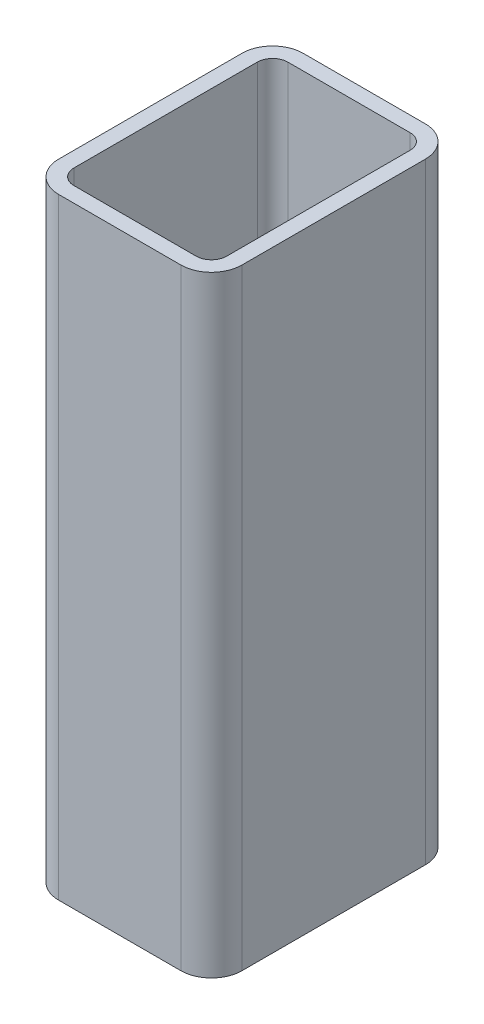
ISO-10303-21;
HEADER;
FILE_DESCRIPTION(('STEP AP214'),'2;1');
FILE_NAME('part.step','',(''),(''),'','','');
FILE_SCHEMA(('AUTOMOTIVE_DESIGN { 1 0 10303 214 1 1 1 1 }'));
ENDSEC;
DATA;
#1=APPLICATION_CONTEXT('core data for automotive mechanical design processes');
#2=APPLICATION_PROTOCOL_DEFINITION('international standard','automotive_design',2000,#1);
#3=PRODUCT_CONTEXT('',#1,'mechanical');
#4=PRODUCT('Part','Part','',(#3));
#5=PRODUCT_RELATED_PRODUCT_CATEGORY('part','',(#4));
#6=PRODUCT_DEFINITION_FORMATION('','',#4);
#7=PRODUCT_DEFINITION_CONTEXT('part definition',#1,'design');
#8=PRODUCT_DEFINITION('design','',#6,#7);
#9=PRODUCT_DEFINITION_SHAPE('','',#8);
#10=(LENGTH_UNIT() NAMED_UNIT(*) SI_UNIT(.MILLI.,.METRE.));
#11=(NAMED_UNIT(*) PLANE_ANGLE_UNIT() SI_UNIT($,.RADIAN.));
#12=(NAMED_UNIT(*) SI_UNIT($,.STERADIAN.) SOLID_ANGLE_UNIT());
#13=UNCERTAINTY_MEASURE_WITH_UNIT(LENGTH_MEASURE(1.E-05),#10,'distance_accuracy_value','');
#14=(GEOMETRIC_REPRESENTATION_CONTEXT(3) GLOBAL_UNCERTAINTY_ASSIGNED_CONTEXT((#13)) GLOBAL_UNIT_ASSIGNED_CONTEXT((#10,
#11,#12)) REPRESENTATION_CONTEXT('',''));
#15=CARTESIAN_POINT('',(0.,0.,0.));
#16=DIRECTION('',(0.,0.,1.));
#17=DIRECTION('',(1.,0.,0.));
#18=AXIS2_PLACEMENT_3D('',#15,#16,#17);
#19=CARTESIAN_POINT('',(-25.4,254.,38.1));
#20=DIRECTION('',(0.,-1.,0.));
#21=DIRECTION('',(0.,0.,-1.));
#22=AXIS2_PLACEMENT_3D('',#19,#20,#21);
#23=CYLINDRICAL_SURFACE('',#22,12.7);
#24=CARTESIAN_POINT('',(-25.4,0.,38.1));
#25=DIRECTION('',(0.,1.,0.));
#26=DIRECTION('',(0.,0.,1.));
#27=AXIS2_PLACEMENT_3D('',#24,#25,#26);
#28=CIRCLE('',#27,12.7);
#29=CARTESIAN_POINT('',(-38.1,0.,38.1));
#30=VERTEX_POINT('',#29);
#31=CARTESIAN_POINT('',(-25.4,0.,50.8));
#32=VERTEX_POINT('',#31);
#33=EDGE_CURVE('E185',#30,#32,#28,.T.);
#34=ORIENTED_EDGE('',*,*,#33,.T.);
#35=DIRECTION('',(0.,-1.,0.));
#36=VECTOR('',#35,1.);
#37=CARTESIAN_POINT('',(-25.4,254.,50.8));
#38=LINE('',#37,#36);
#39=CARTESIAN_POINT('',(-25.4,254.,50.8));
#40=VERTEX_POINT('',#39);
#41=EDGE_CURVE('E11',#40,#32,#38,.T.);
#42=ORIENTED_EDGE('',*,*,#41,.F.);
#43=CARTESIAN_POINT('',(-25.4,254.,38.1));
#44=DIRECTION('',(0.,1.,0.));
#45=DIRECTION('',(0.,0.,1.));
#46=AXIS2_PLACEMENT_3D('',#43,#44,#45);
#47=CIRCLE('',#46,12.7);
#48=CARTESIAN_POINT('',(-38.1,254.,38.1));
#49=VERTEX_POINT('',#48);
#50=EDGE_CURVE('E223',#49,#40,#47,.T.);
#51=ORIENTED_EDGE('',*,*,#50,.F.);
#52=DIRECTION('',(0.,-1.,0.));
#53=VECTOR('',#52,1.);
#54=CARTESIAN_POINT('',(-38.1,254.,38.1));
#55=LINE('',#54,#53);
#56=EDGE_CURVE('E155',#49,#30,#55,.T.);
#57=ORIENTED_EDGE('',*,*,#56,.T.);
#58=EDGE_LOOP('',(#34,#42,#51,#57));
#59=FACE_BOUND('',#58,.T.);
#60=ADVANCED_FACE('F30',(#59),#23,.T.);
#61=CARTESIAN_POINT('',(-25.4,254.,50.8));
#62=DIRECTION('',(0.,0.,-1.));
#63=DIRECTION('',(-1.,0.,0.));
#64=AXIS2_PLACEMENT_3D('',#61,#62,#63);
#65=PLANE('',#64);
#66=DIRECTION('',(1.,0.,0.));
#67=VECTOR('',#66,1.);
#68=CARTESIAN_POINT('',(-25.4,0.,50.8));
#69=LINE('',#68,#67);
#70=CARTESIAN_POINT('',(25.4,0.,50.8));
#71=VERTEX_POINT('',#70);
#72=EDGE_CURVE('E188',#32,#71,#69,.T.);
#73=ORIENTED_EDGE('',*,*,#72,.T.);
#74=DIRECTION('',(0.,-1.,0.));
#75=VECTOR('',#74,1.);
#76=CARTESIAN_POINT('',(25.4,254.,50.8));
#77=LINE('',#76,#75);
#78=CARTESIAN_POINT('',(25.4,254.,50.8));
#79=VERTEX_POINT('',#78);
#80=EDGE_CURVE('E39',#79,#71,#77,.T.);
#81=ORIENTED_EDGE('',*,*,#80,.F.);
#82=DIRECTION('',(1.,0.,0.));
#83=VECTOR('',#82,1.);
#84=CARTESIAN_POINT('',(-25.4,254.,50.8));
#85=LINE('',#84,#83);
#86=EDGE_CURVE('E225',#40,#79,#85,.T.);
#87=ORIENTED_EDGE('',*,*,#86,.F.);
#88=ORIENTED_EDGE('',*,*,#41,.T.);
#89=EDGE_LOOP('',(#73,#81,#87,#88));
#90=FACE_BOUND('',#89,.T.);
#91=ADVANCED_FACE('F299',(#90),#65,.F.);
#92=CARTESIAN_POINT('',(25.4,254.,38.1));
#93=DIRECTION('',(0.,-1.,0.));
#94=DIRECTION('',(0.,0.,-1.));
#95=AXIS2_PLACEMENT_3D('',#92,#93,#94);
#96=CYLINDRICAL_SURFACE('',#95,12.7);
#97=CARTESIAN_POINT('',(25.4,0.,38.1));
#98=DIRECTION('',(0.,1.,0.));
#99=DIRECTION('',(0.,0.,1.));
#100=AXIS2_PLACEMENT_3D('',#97,#98,#99);
#101=CIRCLE('',#100,12.7);
#102=CARTESIAN_POINT('',(38.1,0.,38.1));
#103=VERTEX_POINT('',#102);
#104=EDGE_CURVE('E190',#71,#103,#101,.T.);
#105=ORIENTED_EDGE('',*,*,#104,.T.);
#106=DIRECTION('',(0.,-1.,0.));
#107=VECTOR('',#106,1.);
#108=CARTESIAN_POINT('',(38.1,254.,38.1));
#109=LINE('',#108,#107);
#110=CARTESIAN_POINT('',(38.1,254.,38.1));
#111=VERTEX_POINT('',#110);
#112=EDGE_CURVE('E251',#111,#103,#109,.T.);
#113=ORIENTED_EDGE('',*,*,#112,.F.);
#114=CARTESIAN_POINT('',(25.4,254.,38.1));
#115=DIRECTION('',(0.,1.,0.));
#116=DIRECTION('',(0.,0.,1.));
#117=AXIS2_PLACEMENT_3D('',#114,#115,#116);
#118=CIRCLE('',#117,12.7);
#119=EDGE_CURVE('E227',#79,#111,#118,.T.);
#120=ORIENTED_EDGE('',*,*,#119,.F.);
#121=ORIENTED_EDGE('',*,*,#80,.T.);
#122=EDGE_LOOP('',(#105,#113,#120,#121));
#123=FACE_BOUND('',#122,.T.);
#124=ADVANCED_FACE('F305',(#123),#96,.T.);
#125=CARTESIAN_POINT('',(38.1,254.,-38.1));
#126=DIRECTION('',(-1.,0.,0.));
#127=DIRECTION('',(0.,0.,1.));
#128=AXIS2_PLACEMENT_3D('',#125,#126,#127);
#129=PLANE('',#128);
#130=DIRECTION('',(0.,0.,-1.));
#131=VECTOR('',#130,1.);
#132=CARTESIAN_POINT('',(38.1,0.,-38.1));
#133=LINE('',#132,#131);
#134=CARTESIAN_POINT('',(38.1,0.,-38.1));
#135=VERTEX_POINT('',#134);
#136=EDGE_CURVE('E192',#103,#135,#133,.T.);
#137=ORIENTED_EDGE('',*,*,#136,.T.);
#138=DIRECTION('',(0.,-1.,0.));
#139=VECTOR('',#138,1.);
#140=CARTESIAN_POINT('',(38.1,254.,-38.1));
#141=LINE('',#140,#139);
#142=CARTESIAN_POINT('',(38.1,254.,-38.1));
#143=VERTEX_POINT('',#142);
#144=EDGE_CURVE('E248',#143,#135,#141,.T.);
#145=ORIENTED_EDGE('',*,*,#144,.F.);
#146=DIRECTION('',(0.,0.,-1.));
#147=VECTOR('',#146,1.);
#148=CARTESIAN_POINT('',(38.1,254.,-38.1));
#149=LINE('',#148,#147);
#150=EDGE_CURVE('E229',#111,#143,#149,.T.);
#151=ORIENTED_EDGE('',*,*,#150,.F.);
#152=ORIENTED_EDGE('',*,*,#112,.T.);
#153=EDGE_LOOP('',(#137,#145,#151,#152));
#154=FACE_BOUND('',#153,.T.);
#155=ADVANCED_FACE('F401',(#154),#129,.F.);
#156=CARTESIAN_POINT('',(25.4,254.,-38.1));
#157=DIRECTION('',(0.,-1.,0.));
#158=DIRECTION('',(0.,0.,-1.));
#159=AXIS2_PLACEMENT_3D('',#156,#157,#158);
#160=CYLINDRICAL_SURFACE('',#159,12.7);
#161=CARTESIAN_POINT('',(25.4,0.,-38.1));
#162=DIRECTION('',(0.,1.,0.));
#163=DIRECTION('',(0.,0.,1.));
#164=AXIS2_PLACEMENT_3D('',#161,#162,#163);
#165=CIRCLE('',#164,12.7);
#166=CARTESIAN_POINT('',(25.4,0.,-50.8));
#167=VERTEX_POINT('',#166);
#168=EDGE_CURVE('E194',#135,#167,#165,.T.);
#169=ORIENTED_EDGE('',*,*,#168,.T.);
#170=DIRECTION('',(0.,-1.,0.));
#171=VECTOR('',#170,1.);
#172=CARTESIAN_POINT('',(25.4,254.,-50.8));
#173=LINE('',#172,#171);
#174=CARTESIAN_POINT('',(25.4,254.,-50.8));
#175=VERTEX_POINT('',#174);
#176=EDGE_CURVE('E245',#175,#167,#173,.T.);
#177=ORIENTED_EDGE('',*,*,#176,.F.);
#178=CARTESIAN_POINT('',(25.4,254.,-38.1));
#179=DIRECTION('',(0.,1.,0.));
#180=DIRECTION('',(0.,0.,1.));
#181=AXIS2_PLACEMENT_3D('',#178,#179,#180);
#182=CIRCLE('',#181,12.7);
#183=EDGE_CURVE('E231',#143,#175,#182,.T.);
#184=ORIENTED_EDGE('',*,*,#183,.F.);
#185=ORIENTED_EDGE('',*,*,#144,.T.);
#186=EDGE_LOOP('',(#169,#177,#184,#185));
#187=FACE_BOUND('',#186,.T.);
#188=ADVANCED_FACE('F409',(#187),#160,.T.);
#189=CARTESIAN_POINT('',(25.4,254.,-50.8));
#190=DIRECTION('',(0.,0.,1.));
#191=DIRECTION('',(1.,0.,0.));
#192=AXIS2_PLACEMENT_3D('',#189,#190,#191);
#193=PLANE('',#192);
#194=DIRECTION('',(-1.,0.,0.));
#195=VECTOR('',#194,1.);
#196=CARTESIAN_POINT('',(25.4,0.,-50.8));
#197=LINE('',#196,#195);
#198=CARTESIAN_POINT('',(-25.4,0.,-50.8));
#199=VERTEX_POINT('',#198);
#200=EDGE_CURVE('E196',#167,#199,#197,.T.);
#201=ORIENTED_EDGE('',*,*,#200,.T.);
#202=DIRECTION('',(0.,-1.,0.));
#203=VECTOR('',#202,1.);
#204=CARTESIAN_POINT('',(-25.4,254.,-50.8));
#205=LINE('',#204,#203);
#206=CARTESIAN_POINT('',(-25.4,254.,-50.8));
#207=VERTEX_POINT('',#206);
#208=EDGE_CURVE('E242',#207,#199,#205,.T.);
#209=ORIENTED_EDGE('',*,*,#208,.F.);
#210=DIRECTION('',(-1.,0.,0.));
#211=VECTOR('',#210,1.);
#212=CARTESIAN_POINT('',(25.4,254.,-50.8));
#213=LINE('',#212,#211);
#214=EDGE_CURVE('E233',#175,#207,#213,.T.);
#215=ORIENTED_EDGE('',*,*,#214,.F.);
#216=ORIENTED_EDGE('',*,*,#176,.T.);
#217=EDGE_LOOP('',(#201,#209,#215,#216));
#218=FACE_BOUND('',#217,.T.);
#219=ADVANCED_FACE('F418',(#218),#193,.F.);
#220=CARTESIAN_POINT('',(-25.4,254.,-38.1));
#221=DIRECTION('',(0.,-1.,0.));
#222=DIRECTION('',(0.,0.,-1.));
#223=AXIS2_PLACEMENT_3D('',#220,#221,#222);
#224=CYLINDRICAL_SURFACE('',#223,12.7);
#225=CARTESIAN_POINT('',(-25.4,0.,-38.1));
#226=DIRECTION('',(0.,1.,0.));
#227=DIRECTION('',(0.,0.,1.));
#228=AXIS2_PLACEMENT_3D('',#225,#226,#227);
#229=CIRCLE('',#228,12.7);
#230=CARTESIAN_POINT('',(-38.1,0.,-38.1));
#231=VERTEX_POINT('',#230);
#232=EDGE_CURVE('E198',#199,#231,#229,.T.);
#233=ORIENTED_EDGE('',*,*,#232,.T.);
#234=DIRECTION('',(0.,-1.,0.));
#235=VECTOR('',#234,1.);
#236=CARTESIAN_POINT('',(-38.1,254.,-38.1));
#237=LINE('',#236,#235);
#238=CARTESIAN_POINT('',(-38.1,254.,-38.1));
#239=VERTEX_POINT('',#238);
#240=EDGE_CURVE('E239',#239,#231,#237,.T.);
#241=ORIENTED_EDGE('',*,*,#240,.F.);
#242=CARTESIAN_POINT('',(-25.4,254.,-38.1));
#243=DIRECTION('',(0.,1.,0.));
#244=DIRECTION('',(0.,0.,1.));
#245=AXIS2_PLACEMENT_3D('',#242,#243,#244);
#246=CIRCLE('',#245,12.7);
#247=EDGE_CURVE('E52',#207,#239,#246,.T.);
#248=ORIENTED_EDGE('',*,*,#247,.F.);
#249=ORIENTED_EDGE('',*,*,#208,.T.);
#250=EDGE_LOOP('',(#233,#241,#248,#249));
#251=FACE_BOUND('',#250,.T.);
#252=ADVANCED_FACE('F362',(#251),#224,.T.);
#253=CARTESIAN_POINT('',(25.4,254.,38.1));
#254=DIRECTION('',(0.,-1.,0.));
#255=DIRECTION('',(0.,0.,-1.));
#256=AXIS2_PLACEMENT_3D('',#253,#254,#255);
#257=CYLINDRICAL_SURFACE('',#256,6.34999999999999);
#258=CARTESIAN_POINT('',(25.4,0.,38.1));
#259=DIRECTION('',(0.,1.,0.));
#260=DIRECTION('',(0.,0.,1.));
#261=AXIS2_PLACEMENT_3D('',#258,#259,#260);
#262=CIRCLE('',#261,6.34999999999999);
#263=CARTESIAN_POINT('',(25.4,0.,44.45));
#264=VERTEX_POINT('',#263);
#265=CARTESIAN_POINT('',(31.75,0.,38.1));
#266=VERTEX_POINT('',#265);
#267=EDGE_CURVE('E158',#264,#266,#262,.T.);
#268=ORIENTED_EDGE('',*,*,#267,.F.);
#269=DIRECTION('',(0.,-1.,0.));
#270=VECTOR('',#269,1.);
#271=CARTESIAN_POINT('',(25.4,254.,44.45));
#272=LINE('',#271,#270);
#273=CARTESIAN_POINT('',(25.4,254.,44.45));
#274=VERTEX_POINT('',#273);
#275=EDGE_CURVE('E34',#274,#264,#272,.T.);
#276=ORIENTED_EDGE('',*,*,#275,.F.);
#277=CARTESIAN_POINT('',(25.4,254.,38.1));
#278=DIRECTION('',(0.,1.,0.));
#279=DIRECTION('',(0.,0.,1.));
#280=AXIS2_PLACEMENT_3D('',#277,#278,#279);
#281=CIRCLE('',#280,6.34999999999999);
#282=CARTESIAN_POINT('',(31.75,254.,38.1));
#283=VERTEX_POINT('',#282);
#284=EDGE_CURVE('E202',#274,#283,#281,.T.);
#285=ORIENTED_EDGE('',*,*,#284,.T.);
#286=DIRECTION('',(0.,-1.,0.));
#287=VECTOR('',#286,1.);
#288=CARTESIAN_POINT('',(31.75,254.,38.1));
#289=LINE('',#288,#287);
#290=EDGE_CURVE('E159',#283,#266,#289,.T.);
#291=ORIENTED_EDGE('',*,*,#290,.T.);
#292=EDGE_LOOP('',(#268,#276,#285,#291));
#293=FACE_BOUND('',#292,.T.);
#294=ADVANCED_FACE('F32',(#293),#257,.F.);
#295=CARTESIAN_POINT('',(-25.4,254.,44.45));
#296=DIRECTION('',(0.,0.,-1.));
#297=DIRECTION('',(-1.,0.,0.));
#298=AXIS2_PLACEMENT_3D('',#295,#296,#297);
#299=PLANE('',#298);
#300=DIRECTION('',(1.,0.,0.));
#301=VECTOR('',#300,1.);
#302=CARTESIAN_POINT('',(-25.4,0.,44.45));
#303=LINE('',#302,#301);
#304=CARTESIAN_POINT('',(-25.4,0.,44.45));
#305=VERTEX_POINT('',#304);
#306=EDGE_CURVE('E148',#305,#264,#303,.T.);
#307=ORIENTED_EDGE('',*,*,#306,.F.);
#308=DIRECTION('',(0.,-1.,0.));
#309=VECTOR('',#308,1.);
#310=CARTESIAN_POINT('',(-25.4,254.,44.45));
#311=LINE('',#310,#309);
#312=CARTESIAN_POINT('',(-25.4,254.,44.45));
#313=VERTEX_POINT('',#312);
#314=EDGE_CURVE('E156',#313,#305,#311,.T.);
#315=ORIENTED_EDGE('',*,*,#314,.F.);
#316=DIRECTION('',(1.,0.,0.));
#317=VECTOR('',#316,1.);
#318=CARTESIAN_POINT('',(-25.4,254.,44.45));
#319=LINE('',#318,#317);
#320=EDGE_CURVE('E151',#313,#274,#319,.T.);
#321=ORIENTED_EDGE('',*,*,#320,.T.);
#322=ORIENTED_EDGE('',*,*,#275,.T.);
#323=EDGE_LOOP('',(#307,#315,#321,#322));
#324=FACE_BOUND('',#323,.T.);
#325=ADVANCED_FACE('F146',(#324),#299,.T.);
#326=CARTESIAN_POINT('',(-25.4,254.,38.1));
#327=DIRECTION('',(0.,-1.,0.));
#328=DIRECTION('',(0.,0.,-1.));
#329=AXIS2_PLACEMENT_3D('',#326,#327,#328);
#330=CYLINDRICAL_SURFACE('',#329,6.34999999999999);
#331=CARTESIAN_POINT('',(-25.4,0.,38.1));
#332=DIRECTION('',(0.,1.,0.));
#333=DIRECTION('',(0.,0.,1.));
#334=AXIS2_PLACEMENT_3D('',#331,#332,#333);
#335=CIRCLE('',#334,6.34999999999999);
#336=CARTESIAN_POINT('',(-31.75,0.,38.1));
#337=VERTEX_POINT('',#336);
#338=EDGE_CURVE('E168',#337,#305,#335,.T.);
#339=ORIENTED_EDGE('',*,*,#338,.F.);
#340=DIRECTION('',(0.,-1.,0.));
#341=VECTOR('',#340,1.);
#342=CARTESIAN_POINT('',(-31.75,254.,38.1));
#343=LINE('',#342,#341);
#344=CARTESIAN_POINT('',(-31.75,254.,38.1));
#345=VERTEX_POINT('',#344);
#346=EDGE_CURVE('E265',#345,#337,#343,.T.);
#347=ORIENTED_EDGE('',*,*,#346,.F.);
#348=CARTESIAN_POINT('',(-25.4,254.,38.1));
#349=DIRECTION('',(0.,1.,0.));
#350=DIRECTION('',(0.,0.,1.));
#351=AXIS2_PLACEMENT_3D('',#348,#349,#350);
#352=CIRCLE('',#351,6.34999999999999);
#353=EDGE_CURVE('E205',#345,#313,#352,.T.);
#354=ORIENTED_EDGE('',*,*,#353,.T.);
#355=ORIENTED_EDGE('',*,*,#314,.T.);
#356=EDGE_LOOP('',(#339,#347,#354,#355));
#357=FACE_BOUND('',#356,.T.);
#358=ADVANCED_FACE('F267',(#357),#330,.F.);
#359=CARTESIAN_POINT('',(-31.75,254.,38.1));
#360=DIRECTION('',(1.,0.,0.));
#361=DIRECTION('',(0.,0.,-1.));
#362=AXIS2_PLACEMENT_3D('',#359,#360,#361);
#363=PLANE('',#362);
#364=DIRECTION('',(0.,0.,1.));
#365=VECTOR('',#364,1.);
#366=CARTESIAN_POINT('',(-31.75,0.,38.1));
#367=LINE('',#366,#365);
#368=CARTESIAN_POINT('',(-31.75,0.,-38.1));
#369=VERTEX_POINT('',#368);
#370=EDGE_CURVE('E170',#369,#337,#367,.T.);
#371=ORIENTED_EDGE('',*,*,#370,.F.);
#372=DIRECTION('',(0.,-1.,0.));
#373=VECTOR('',#372,1.);
#374=CARTESIAN_POINT('',(-31.75,254.,-38.1));
#375=LINE('',#374,#373);
#376=CARTESIAN_POINT('',(-31.75,254.,-38.1));
#377=VERTEX_POINT('',#376);
#378=EDGE_CURVE('E263',#377,#369,#375,.T.);
#379=ORIENTED_EDGE('',*,*,#378,.F.);
#380=DIRECTION('',(0.,0.,1.));
#381=VECTOR('',#380,1.);
#382=CARTESIAN_POINT('',(-31.75,254.,38.1));
#383=LINE('',#382,#381);
#384=EDGE_CURVE('E208',#377,#345,#383,.T.);
#385=ORIENTED_EDGE('',*,*,#384,.T.);
#386=ORIENTED_EDGE('',*,*,#346,.T.);
#387=EDGE_LOOP('',(#371,#379,#385,#386));
#388=FACE_BOUND('',#387,.T.);
#389=ADVANCED_FACE('F289',(#388),#363,.T.);
#390=CARTESIAN_POINT('',(-25.4,254.,-38.1));
#391=DIRECTION('',(0.,-1.,0.));
#392=DIRECTION('',(0.,0.,-1.));
#393=AXIS2_PLACEMENT_3D('',#390,#391,#392);
#394=CYLINDRICAL_SURFACE('',#393,6.34999999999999);
#395=CARTESIAN_POINT('',(-25.4,0.,-38.1));
#396=DIRECTION('',(0.,1.,0.));
#397=DIRECTION('',(0.,0.,1.));
#398=AXIS2_PLACEMENT_3D('',#395,#396,#397);
#399=CIRCLE('',#398,6.34999999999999);
#400=CARTESIAN_POINT('',(-25.4,0.,-44.45));
#401=VERTEX_POINT('',#400);
#402=EDGE_CURVE('E174',#401,#369,#399,.T.);
#403=ORIENTED_EDGE('',*,*,#402,.F.);
#404=DIRECTION('',(0.,-1.,0.));
#405=VECTOR('',#404,1.);
#406=CARTESIAN_POINT('',(-25.4,254.,-44.45));
#407=LINE('',#406,#405);
#408=CARTESIAN_POINT('',(-25.4,254.,-44.45));
#409=VERTEX_POINT('',#408);
#410=EDGE_CURVE('E261',#409,#401,#407,.T.);
#411=ORIENTED_EDGE('',*,*,#410,.F.);
#412=CARTESIAN_POINT('',(-25.4,254.,-38.1));
#413=DIRECTION('',(0.,1.,0.));
#414=DIRECTION('',(0.,0.,1.));
#415=AXIS2_PLACEMENT_3D('',#412,#413,#414);
#416=CIRCLE('',#415,6.34999999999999);
#417=EDGE_CURVE('E211',#409,#377,#416,.T.);
#418=ORIENTED_EDGE('',*,*,#417,.T.);
#419=ORIENTED_EDGE('',*,*,#378,.T.);
#420=EDGE_LOOP('',(#403,#411,#418,#419));
#421=FACE_BOUND('',#420,.T.);
#422=ADVANCED_FACE('F286',(#421),#394,.F.);
#423=CARTESIAN_POINT('',(25.4,254.,-44.45));
#424=DIRECTION('',(0.,0.,1.));
#425=DIRECTION('',(1.,0.,0.));
#426=AXIS2_PLACEMENT_3D('',#423,#424,#425);
#427=PLANE('',#426);
#428=DIRECTION('',(-1.,0.,0.));
#429=VECTOR('',#428,1.);
#430=CARTESIAN_POINT('',(25.4,0.,-44.45));
#431=LINE('',#430,#429);
#432=CARTESIAN_POINT('',(25.4,0.,-44.45));
#433=VERTEX_POINT('',#432);
#434=EDGE_CURVE('E177',#433,#401,#431,.T.);
#435=ORIENTED_EDGE('',*,*,#434,.F.);
#436=DIRECTION('',(0.,-1.,0.));
#437=VECTOR('',#436,1.);
#438=CARTESIAN_POINT('',(25.4,254.,-44.45));
#439=LINE('',#438,#437);
#440=CARTESIAN_POINT('',(25.4,254.,-44.45));
#441=VERTEX_POINT('',#440);
#442=EDGE_CURVE('E259',#441,#433,#439,.T.);
#443=ORIENTED_EDGE('',*,*,#442,.F.);
#444=DIRECTION('',(-1.,0.,0.));
#445=VECTOR('',#444,1.);
#446=CARTESIAN_POINT('',(25.4,254.,-44.45));
#447=LINE('',#446,#445);
#448=EDGE_CURVE('E214',#441,#409,#447,.T.);
#449=ORIENTED_EDGE('',*,*,#448,.T.);
#450=ORIENTED_EDGE('',*,*,#410,.T.);
#451=EDGE_LOOP('',(#435,#443,#449,#450));
#452=FACE_BOUND('',#451,.T.);
#453=ADVANCED_FACE('F282',(#452),#427,.T.);
#454=CARTESIAN_POINT('',(25.4,254.,-38.1));
#455=DIRECTION('',(0.,-1.,0.));
#456=DIRECTION('',(0.,0.,-1.));
#457=AXIS2_PLACEMENT_3D('',#454,#455,#456);
#458=CYLINDRICAL_SURFACE('',#457,6.34999999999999);
#459=CARTESIAN_POINT('',(25.4,0.,-38.1));
#460=DIRECTION('',(0.,1.,0.));
#461=DIRECTION('',(0.,0.,1.));
#462=AXIS2_PLACEMENT_3D('',#459,#460,#461);
#463=CIRCLE('',#462,6.34999999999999);
#464=CARTESIAN_POINT('',(31.75,0.,-38.1));
#465=VERTEX_POINT('',#464);
#466=EDGE_CURVE('E180',#465,#433,#463,.T.);
#467=ORIENTED_EDGE('',*,*,#466,.F.);
#468=DIRECTION('',(0.,-1.,0.));
#469=VECTOR('',#468,1.);
#470=CARTESIAN_POINT('',(31.75,254.,-38.1));
#471=LINE('',#470,#469);
#472=CARTESIAN_POINT('',(31.75,254.,-38.1));
#473=VERTEX_POINT('',#472);
#474=EDGE_CURVE('E257',#473,#465,#471,.T.);
#475=ORIENTED_EDGE('',*,*,#474,.F.);
#476=CARTESIAN_POINT('',(25.4,254.,-38.1));
#477=DIRECTION('',(0.,1.,0.));
#478=DIRECTION('',(0.,0.,1.));
#479=AXIS2_PLACEMENT_3D('',#476,#477,#478);
#480=CIRCLE('',#479,6.34999999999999);
#481=EDGE_CURVE('E217',#473,#441,#480,.T.);
#482=ORIENTED_EDGE('',*,*,#481,.T.);
#483=ORIENTED_EDGE('',*,*,#442,.T.);
#484=EDGE_LOOP('',(#467,#475,#482,#483));
#485=FACE_BOUND('',#484,.T.);
#486=ADVANCED_FACE('F280',(#485),#458,.F.);
#487=CARTESIAN_POINT('',(31.75,254.,-38.1));
#488=DIRECTION('',(-1.,0.,0.));
#489=DIRECTION('',(0.,0.,1.));
#490=AXIS2_PLACEMENT_3D('',#487,#488,#489);
#491=PLANE('',#490);
#492=DIRECTION('',(0.,0.,-1.));
#493=VECTOR('',#492,1.);
#494=CARTESIAN_POINT('',(31.75,0.,-38.1));
#495=LINE('',#494,#493);
#496=EDGE_CURVE('E183',#266,#465,#495,.T.);
#497=ORIENTED_EDGE('',*,*,#496,.F.);
#498=ORIENTED_EDGE('',*,*,#290,.F.);
#499=DIRECTION('',(0.,0.,-1.));
#500=VECTOR('',#499,1.);
#501=CARTESIAN_POINT('',(31.75,254.,-38.1));
#502=LINE('',#501,#500);
#503=EDGE_CURVE('E220',#283,#473,#502,.T.);
#504=ORIENTED_EDGE('',*,*,#503,.T.);
#505=ORIENTED_EDGE('',*,*,#474,.T.);
#506=EDGE_LOOP('',(#497,#498,#504,#505));
#507=FACE_BOUND('',#506,.T.);
#508=ADVANCED_FACE('F276',(#507),#491,.T.);
#509=CARTESIAN_POINT('',(-38.1,254.,38.1));
#510=DIRECTION('',(1.,0.,0.));
#511=DIRECTION('',(0.,0.,-1.));
#512=AXIS2_PLACEMENT_3D('',#509,#510,#511);
#513=PLANE('',#512);
#514=DIRECTION('',(0.,0.,1.));
#515=VECTOR('',#514,1.);
#516=CARTESIAN_POINT('',(-38.1,0.,38.1));
#517=LINE('',#516,#515);
#518=EDGE_CURVE('E200',#231,#30,#517,.T.);
#519=ORIENTED_EDGE('',*,*,#518,.T.);
#520=ORIENTED_EDGE('',*,*,#56,.F.);
#521=DIRECTION('',(0.,0.,1.));
#522=VECTOR('',#521,1.);
#523=CARTESIAN_POINT('',(-38.1,254.,38.1));
#524=LINE('',#523,#522);
#525=EDGE_CURVE('E47',#239,#49,#524,.T.);
#526=ORIENTED_EDGE('',*,*,#525,.F.);
#527=ORIENTED_EDGE('',*,*,#240,.T.);
#528=EDGE_LOOP('',(#519,#520,#526,#527));
#529=FACE_BOUND('',#528,.T.);
#530=ADVANCED_FACE('F312',(#529),#513,.F.);
#531=CARTESIAN_POINT('',(-25.4,254.,38.1));
#532=DIRECTION('',(0.,1.,0.));
#533=DIRECTION('',(0.,0.,1.));
#534=AXIS2_PLACEMENT_3D('',#531,#532,#533);
#535=PLANE('',#534);
#536=ORIENTED_EDGE('',*,*,#284,.F.);
#537=ORIENTED_EDGE('',*,*,#320,.F.);
#538=ORIENTED_EDGE('',*,*,#353,.F.);
#539=ORIENTED_EDGE('',*,*,#384,.F.);
#540=ORIENTED_EDGE('',*,*,#417,.F.);
#541=ORIENTED_EDGE('',*,*,#448,.F.);
#542=ORIENTED_EDGE('',*,*,#481,.F.);
#543=ORIENTED_EDGE('',*,*,#503,.F.);
#544=EDGE_LOOP('',(#536,#537,#538,#539,#540,#541,#542,#543));
#545=FACE_BOUND('',#544,.T.);
#546=ORIENTED_EDGE('',*,*,#50,.T.);
#547=ORIENTED_EDGE('',*,*,#86,.T.);
#548=ORIENTED_EDGE('',*,*,#119,.T.);
#549=ORIENTED_EDGE('',*,*,#150,.T.);
#550=ORIENTED_EDGE('',*,*,#183,.T.);
#551=ORIENTED_EDGE('',*,*,#214,.T.);
#552=ORIENTED_EDGE('',*,*,#247,.T.);
#553=ORIENTED_EDGE('',*,*,#525,.T.);
#554=EDGE_LOOP('',(#546,#547,#548,#549,#550,#551,#552,#553));
#555=FACE_BOUND('',#554,.T.);
#556=ADVANCED_FACE('F270',(#545,#555),#535,.T.);
#557=CARTESIAN_POINT('',(-25.4,0.,38.1));
#558=DIRECTION('',(0.,1.,0.));
#559=DIRECTION('',(0.,0.,1.));
#560=AXIS2_PLACEMENT_3D('',#557,#558,#559);
#561=PLANE('',#560);
#562=ORIENTED_EDGE('',*,*,#267,.T.);
#563=ORIENTED_EDGE('',*,*,#496,.T.);
#564=ORIENTED_EDGE('',*,*,#466,.T.);
#565=ORIENTED_EDGE('',*,*,#434,.T.);
#566=ORIENTED_EDGE('',*,*,#402,.T.);
#567=ORIENTED_EDGE('',*,*,#370,.T.);
#568=ORIENTED_EDGE('',*,*,#338,.T.);
#569=ORIENTED_EDGE('',*,*,#306,.T.);
#570=EDGE_LOOP('',(#562,#563,#564,#565,#566,#567,#568,#569));
#571=FACE_BOUND('',#570,.T.);
#572=ORIENTED_EDGE('',*,*,#33,.F.);
#573=ORIENTED_EDGE('',*,*,#518,.F.);
#574=ORIENTED_EDGE('',*,*,#232,.F.);
#575=ORIENTED_EDGE('',*,*,#200,.F.);
#576=ORIENTED_EDGE('',*,*,#168,.F.);
#577=ORIENTED_EDGE('',*,*,#136,.F.);
#578=ORIENTED_EDGE('',*,*,#104,.F.);
#579=ORIENTED_EDGE('',*,*,#72,.F.);
#580=EDGE_LOOP('',(#572,#573,#574,#575,#576,#577,#578,#579));
#581=FACE_BOUND('',#580,.T.);
#582=ADVANCED_FACE('F164',(#571,#581),#561,.F.);
#583=CLOSED_SHELL('',(#60,#91,#124,#155,#188,#219,#252,#294,#325,#358,#389,#422,#453,#486,#508,
#530,#556,#582));
#584=MANIFOLD_SOLID_BREP('B2',#583);
#585=ADVANCED_BREP_SHAPE_REPRESENTATION('',(#18,#584),#14);
#586=SHAPE_DEFINITION_REPRESENTATION(#9,#585);
ENDSEC;
END-ISO-10303-21;
